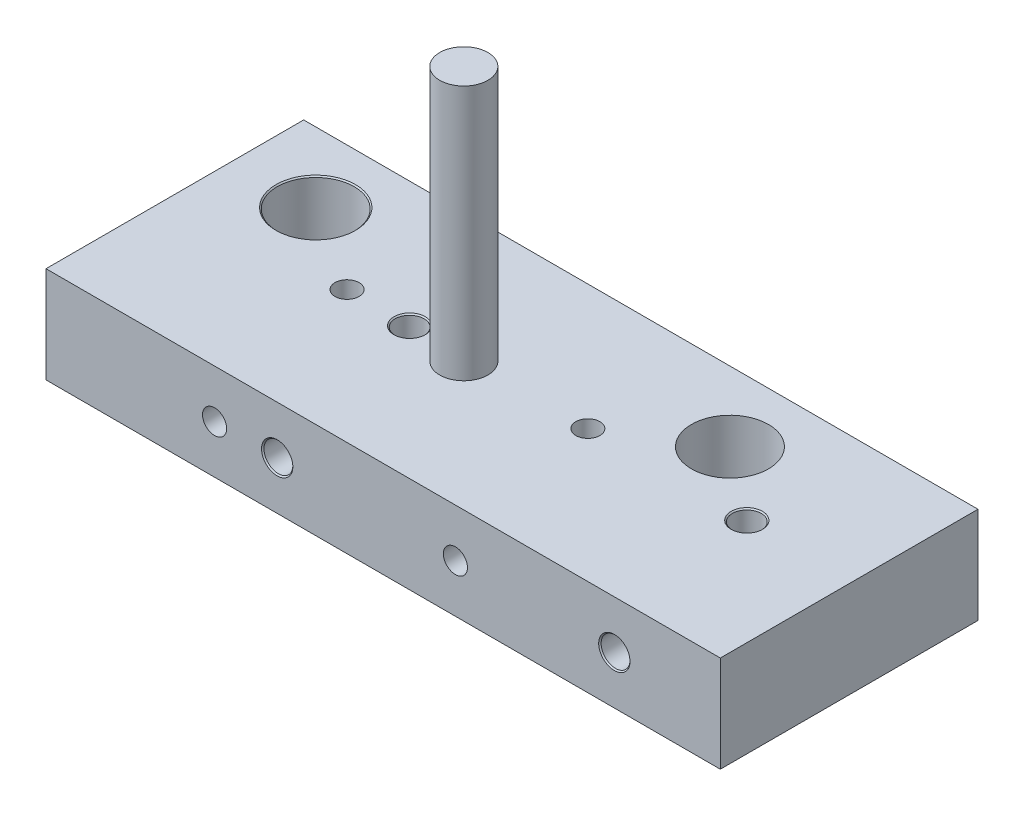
ISO-10303-21;
HEADER;
FILE_DESCRIPTION(('STEP AP214'),'2;1');
FILE_NAME('part.step','',(''),(''),'','','');
FILE_SCHEMA(('AUTOMOTIVE_DESIGN { 1 0 10303 214 1 1 1 1 }'));
ENDSEC;
DATA;
#1=APPLICATION_CONTEXT('core data for automotive mechanical design processes');
#2=APPLICATION_PROTOCOL_DEFINITION('international standard','automotive_design',2000,#1);
#3=PRODUCT_CONTEXT('',#1,'mechanical');
#4=PRODUCT('Part','Part','',(#3));
#5=PRODUCT_RELATED_PRODUCT_CATEGORY('part','',(#4));
#6=PRODUCT_DEFINITION_FORMATION('','',#4);
#7=PRODUCT_DEFINITION_CONTEXT('part definition',#1,'design');
#8=PRODUCT_DEFINITION('design','',#6,#7);
#9=PRODUCT_DEFINITION_SHAPE('','',#8);
#10=(LENGTH_UNIT() NAMED_UNIT(*) SI_UNIT(.MILLI.,.METRE.));
#11=(NAMED_UNIT(*) PLANE_ANGLE_UNIT() SI_UNIT($,.RADIAN.));
#12=(NAMED_UNIT(*) SI_UNIT($,.STERADIAN.) SOLID_ANGLE_UNIT());
#13=UNCERTAINTY_MEASURE_WITH_UNIT(LENGTH_MEASURE(1.E-05),#10,'distance_accuracy_value','');
#14=(GEOMETRIC_REPRESENTATION_CONTEXT(3) GLOBAL_UNCERTAINTY_ASSIGNED_CONTEXT((#13)) GLOBAL_UNIT_ASSIGNED_CONTEXT((#10,
#11,#12)) REPRESENTATION_CONTEXT('',''));
#15=CARTESIAN_POINT('',(0.,0.,0.));
#16=DIRECTION('',(0.,0.,1.));
#17=DIRECTION('',(1.,0.,0.));
#18=AXIS2_PLACEMENT_3D('',#15,#16,#17);
#19=CARTESIAN_POINT('',(0.,20.,-53.5));
#20=DIRECTION('',(0.,-1.,0.));
#21=DIRECTION('',(0.,0.,-1.));
#22=AXIS2_PLACEMENT_3D('',#19,#20,#21);
#23=PLANE('',#22);
#24=CARTESIAN_POINT('',(103.,20.,-39.));
#25=DIRECTION('',(0.,-1.,0.));
#26=DIRECTION('',(0.,0.,-1.));
#27=AXIS2_PLACEMENT_3D('',#24,#25,#26);
#28=CIRCLE('',#27,7.99999999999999);
#29=CARTESIAN_POINT('',(103.,20.,-47.));
#30=VERTEX_POINT('',#29);
#31=EDGE_CURVE('E9179',#30,#30,#28,.T.);
#32=ORIENTED_EDGE('',*,*,#31,.T.);
#33=EDGE_LOOP('',(#32));
#34=FACE_BOUND('',#33,.T.);
#35=DIRECTION('',(0.,0.,1.));
#36=VECTOR('',#35,1.);
#37=CARTESIAN_POINT('',(0.,20.,0.));
#38=LINE('',#37,#36);
#39=CARTESIAN_POINT('',(0.,20.,-53.5));
#40=VERTEX_POINT('',#39);
#41=CARTESIAN_POINT('',(0.,20.,0.));
#42=VERTEX_POINT('',#41);
#43=EDGE_CURVE('E9307',#40,#42,#38,.T.);
#44=ORIENTED_EDGE('',*,*,#43,.T.);
#45=DIRECTION('',(1.,0.,0.));
#46=VECTOR('',#45,1.);
#47=CARTESIAN_POINT('',(0.,20.,0.));
#48=LINE('',#47,#46);
#49=CARTESIAN_POINT('',(140.,20.,0.));
#50=VERTEX_POINT('',#49);
#51=EDGE_CURVE('E9305',#42,#50,#48,.T.);
#52=ORIENTED_EDGE('',*,*,#51,.T.);
#53=DIRECTION('',(0.,0.,-1.));
#54=VECTOR('',#53,1.);
#55=CARTESIAN_POINT('',(140.,20.,0.));
#56=LINE('',#55,#54);
#57=CARTESIAN_POINT('',(140.,20.,-53.5));
#58=VERTEX_POINT('',#57);
#59=EDGE_CURVE('E9303',#50,#58,#56,.T.);
#60=ORIENTED_EDGE('',*,*,#59,.T.);
#61=DIRECTION('',(-1.,0.,0.));
#62=VECTOR('',#61,1.);
#63=CARTESIAN_POINT('',(0.,20.,-53.5));
#64=LINE('',#63,#62);
#65=EDGE_CURVE('E9301',#58,#40,#64,.T.);
#66=ORIENTED_EDGE('',*,*,#65,.T.);
#67=EDGE_LOOP('',(#44,#52,#60,#66));
#68=FACE_BOUND('',#67,.T.);
#69=CARTESIAN_POINT('',(17.,20.,-39.));
#70=DIRECTION('',(0.,-1.,0.));
#71=DIRECTION('',(0.,0.,-1.));
#72=AXIS2_PLACEMENT_3D('',#69,#70,#71);
#73=CIRCLE('',#72,8.24999999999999);
#74=CARTESIAN_POINT('',(17.,20.,-47.25));
#75=VERTEX_POINT('',#74);
#76=EDGE_CURVE('E9328',#75,#75,#73,.T.);
#77=ORIENTED_EDGE('',*,*,#76,.T.);
#78=EDGE_LOOP('',(#77));
#79=FACE_BOUND('',#78,.T.);
#80=CARTESIAN_POINT('',(35.,20.,-27.5));
#81=DIRECTION('',(0.,-1.,0.));
#82=DIRECTION('',(0.,0.,-1.));
#83=AXIS2_PLACEMENT_3D('',#80,#81,#82);
#84=CIRCLE('',#83,2.5);
#85=CARTESIAN_POINT('',(35.,20.,-30.));
#86=VERTEX_POINT('',#85);
#87=EDGE_CURVE('E9334',#86,#86,#84,.T.);
#88=ORIENTED_EDGE('',*,*,#87,.T.);
#89=EDGE_LOOP('',(#88));
#90=FACE_BOUND('',#89,.T.);
#91=CARTESIAN_POINT('',(85.,20.,-27.5));
#92=DIRECTION('',(0.,-1.,0.));
#93=DIRECTION('',(0.,0.,-1.));
#94=AXIS2_PLACEMENT_3D('',#91,#92,#93);
#95=CIRCLE('',#94,2.49999999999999);
#96=CARTESIAN_POINT('',(85.,20.,-30.));
#97=VERTEX_POINT('',#96);
#98=EDGE_CURVE('E9340',#97,#97,#95,.T.);
#99=ORIENTED_EDGE('',*,*,#98,.T.);
#100=EDGE_LOOP('',(#99));
#101=FACE_BOUND('',#100,.T.);
#102=CARTESIAN_POINT('',(48.,20.,-27.5));
#103=DIRECTION('',(0.,-1.,0.));
#104=DIRECTION('',(0.,0.,-1.));
#105=AXIS2_PLACEMENT_3D('',#102,#103,#104);
#106=CIRCLE('',#105,3.25);
#107=CARTESIAN_POINT('',(48.,20.,-30.75));
#108=VERTEX_POINT('',#107);
#109=EDGE_CURVE('E9352',#108,#108,#106,.T.);
#110=ORIENTED_EDGE('',*,*,#109,.T.);
#111=EDGE_LOOP('',(#110));
#112=FACE_BOUND('',#111,.T.);
#113=CARTESIAN_POINT('',(118.,20.,-27.5));
#114=DIRECTION('',(0.,-1.,0.));
#115=DIRECTION('',(0.,0.,-1.));
#116=AXIS2_PLACEMENT_3D('',#113,#114,#115);
#117=CIRCLE('',#116,3.24999999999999);
#118=CARTESIAN_POINT('',(118.,20.,-30.75));
#119=VERTEX_POINT('',#118);
#120=EDGE_CURVE('E9364',#119,#119,#117,.T.);
#121=ORIENTED_EDGE('',*,*,#120,.T.);
#122=EDGE_LOOP('',(#121));
#123=FACE_BOUND('',#122,.T.);
#124=CARTESIAN_POINT('',(60.,20.,-26.75));
#125=DIRECTION('',(0.,-1.,0.));
#126=DIRECTION('',(0.,0.,-1.));
#127=AXIS2_PLACEMENT_3D('',#124,#125,#126);
#128=CIRCLE('',#127,5.);
#129=CARTESIAN_POINT('',(60.,20.,-31.75));
#130=VERTEX_POINT('',#129);
#131=EDGE_CURVE('E11',#130,#130,#128,.F.);
#132=ORIENTED_EDGE('',*,*,#131,.F.);
#133=EDGE_LOOP('',(#132));
#134=FACE_BOUND('',#133,.T.);
#135=ADVANCED_FACE('F9175',(#34,#68,#79,#90,#101,#112,#123,#134),#23,.F.);
#136=CARTESIAN_POINT('',(85.,0.,-27.5));
#137=DIRECTION('',(0.,-1.,0.));
#138=DIRECTION('',(0.,0.,-1.));
#139=AXIS2_PLACEMENT_3D('',#136,#137,#138);
#140=CYLINDRICAL_SURFACE('',#139,2.49999999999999);
#141=CARTESIAN_POINT('',(85.,0.,-27.5));
#142=DIRECTION('',(0.,-1.,0.));
#143=DIRECTION('',(0.,0.,-1.));
#144=AXIS2_PLACEMENT_3D('',#141,#142,#143);
#145=CIRCLE('',#144,2.49999999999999);
#146=CARTESIAN_POINT('',(85.,0.,-30.));
#147=VERTEX_POINT('',#146);
#148=EDGE_CURVE('E9337',#147,#147,#145,.T.);
#149=ORIENTED_EDGE('',*,*,#148,.T.);
#150=EDGE_LOOP('',(#149));
#151=FACE_BOUND('',#150,.T.);
#152=CARTESIAN_POINT('',(85.,10.,-27.5));
#153=DIRECTION('',(0.,-0.707106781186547,-0.707106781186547));
#154=DIRECTION('',(0.,-0.707106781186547,0.707106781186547));
#155=AXIS2_PLACEMENT_3D('',#152,#153,#154);
#156=ELLIPSE('',#155,3.53553390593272,2.49999999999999);
#157=CARTESIAN_POINT('',(82.5,10.,-27.5));
#158=VERTEX_POINT('',#157);
#159=CARTESIAN_POINT('',(87.5,10.,-27.5));
#160=VERTEX_POINT('',#159);
#161=EDGE_CURVE('E9190',#158,#160,#156,.F.);
#162=ORIENTED_EDGE('',*,*,#161,.T.);
#163=CARTESIAN_POINT('',(85.,10.,-27.5));
#164=DIRECTION('',(0.,-0.707106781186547,0.707106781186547));
#165=DIRECTION('',(0.,-0.707106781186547,-0.707106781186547));
#166=AXIS2_PLACEMENT_3D('',#163,#164,#165);
#167=ELLIPSE('',#166,3.53553390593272,2.49999999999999);
#168=EDGE_CURVE('E9184',#160,#158,#167,.F.);
#169=ORIENTED_EDGE('',*,*,#168,.T.);
#170=EDGE_LOOP('',(#162,#169));
#171=FACE_BOUND('',#170,.T.);
#172=ADVANCED_FACE('F9253',(#151,#171),#140,.F.);
#173=CARTESIAN_POINT('',(35.,0.,-27.5));
#174=DIRECTION('',(0.,-1.,0.));
#175=DIRECTION('',(0.,0.,-1.));
#176=AXIS2_PLACEMENT_3D('',#173,#174,#175);
#177=CYLINDRICAL_SURFACE('',#176,2.49999999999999);
#178=CARTESIAN_POINT('',(35.,0.,-27.5));
#179=DIRECTION('',(0.,-1.,0.));
#180=DIRECTION('',(0.,0.,-1.));
#181=AXIS2_PLACEMENT_3D('',#178,#179,#180);
#182=CIRCLE('',#181,2.49999999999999);
#183=CARTESIAN_POINT('',(35.,0.,-30.));
#184=VERTEX_POINT('',#183);
#185=EDGE_CURVE('E9331',#184,#184,#182,.T.);
#186=ORIENTED_EDGE('',*,*,#185,.T.);
#187=EDGE_LOOP('',(#186));
#188=FACE_BOUND('',#187,.T.);
#189=CARTESIAN_POINT('',(35.,10.,-27.5));
#190=DIRECTION('',(0.,-0.707106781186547,-0.707106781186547));
#191=DIRECTION('',(0.,-0.707106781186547,0.707106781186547));
#192=AXIS2_PLACEMENT_3D('',#189,#190,#191);
#193=ELLIPSE('',#192,3.53553390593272,2.49999999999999);
#194=CARTESIAN_POINT('',(32.5,10.,-27.5));
#195=VERTEX_POINT('',#194);
#196=CARTESIAN_POINT('',(37.5,10.,-27.5));
#197=VERTEX_POINT('',#196);
#198=EDGE_CURVE('E9197',#195,#197,#193,.F.);
#199=ORIENTED_EDGE('',*,*,#198,.T.);
#200=CARTESIAN_POINT('',(35.,10.,-27.5));
#201=DIRECTION('',(0.,-0.707106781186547,0.707106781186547));
#202=DIRECTION('',(0.,-0.707106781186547,-0.707106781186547));
#203=AXIS2_PLACEMENT_3D('',#200,#201,#202);
#204=ELLIPSE('',#203,3.53553390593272,2.49999999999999);
#205=EDGE_CURVE('E9251',#197,#195,#204,.F.);
#206=ORIENTED_EDGE('',*,*,#205,.T.);
#207=EDGE_LOOP('',(#199,#206));
#208=FACE_BOUND('',#207,.T.);
#209=ADVANCED_FACE('F9550',(#188,#208),#177,.F.);
#210=CARTESIAN_POINT('',(118.,0.,-27.5));
#211=DIRECTION('',(0.,-1.,0.));
#212=DIRECTION('',(0.,0.,-1.));
#213=AXIS2_PLACEMENT_3D('',#210,#211,#212);
#214=CYLINDRICAL_SURFACE('',#213,3.);
#215=CARTESIAN_POINT('',(118.,0.250000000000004,-27.5));
#216=DIRECTION('',(0.,-1.,0.));
#217=DIRECTION('',(0.,0.,-1.));
#218=AXIS2_PLACEMENT_3D('',#215,#216,#217);
#219=CIRCLE('',#218,3.);
#220=CARTESIAN_POINT('',(118.,0.250000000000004,-30.5));
#221=VERTEX_POINT('',#220);
#222=EDGE_CURVE('E9358',#221,#221,#219,.T.);
#223=ORIENTED_EDGE('',*,*,#222,.T.);
#224=EDGE_LOOP('',(#223));
#225=FACE_BOUND('',#224,.T.);
#226=CARTESIAN_POINT('',(118.,10.,-27.5));
#227=DIRECTION('',(0.,-0.707106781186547,-0.707106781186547));
#228=DIRECTION('',(0.,-0.707106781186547,0.707106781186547));
#229=AXIS2_PLACEMENT_3D('',#226,#227,#228);
#230=ELLIPSE('',#229,4.24264068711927,2.99999999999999);
#231=CARTESIAN_POINT('',(115.,10.,-27.5));
#232=VERTEX_POINT('',#231);
#233=CARTESIAN_POINT('',(121.,10.,-27.5));
#234=VERTEX_POINT('',#233);
#235=EDGE_CURVE('E9276',#232,#234,#230,.F.);
#236=ORIENTED_EDGE('',*,*,#235,.T.);
#237=CARTESIAN_POINT('',(118.,10.,-27.5));
#238=DIRECTION('',(0.,-0.707106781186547,0.707106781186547));
#239=DIRECTION('',(0.,-0.707106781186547,-0.707106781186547));
#240=AXIS2_PLACEMENT_3D('',#237,#238,#239);
#241=ELLIPSE('',#240,4.24264068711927,2.99999999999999);
#242=EDGE_CURVE('E9267',#234,#232,#241,.F.);
#243=ORIENTED_EDGE('',*,*,#242,.T.);
#244=EDGE_LOOP('',(#236,#243));
#245=FACE_BOUND('',#244,.T.);
#246=ADVANCED_FACE('F9526',(#225,#245),#214,.F.);
#247=CARTESIAN_POINT('',(48.,0.,-27.5));
#248=DIRECTION('',(0.,-1.,0.));
#249=DIRECTION('',(0.,0.,-1.));
#250=AXIS2_PLACEMENT_3D('',#247,#248,#249);
#251=CYLINDRICAL_SURFACE('',#250,3.);
#252=CARTESIAN_POINT('',(48.,0.250000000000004,-27.5));
#253=DIRECTION('',(0.,-1.,0.));
#254=DIRECTION('',(0.,0.,-1.));
#255=AXIS2_PLACEMENT_3D('',#252,#253,#254);
#256=CIRCLE('',#255,3.);
#257=CARTESIAN_POINT('',(48.,0.250000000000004,-30.5));
#258=VERTEX_POINT('',#257);
#259=EDGE_CURVE('E9346',#258,#258,#256,.T.);
#260=ORIENTED_EDGE('',*,*,#259,.T.);
#261=EDGE_LOOP('',(#260));
#262=FACE_BOUND('',#261,.T.);
#263=CARTESIAN_POINT('',(48.,10.,-27.5));
#264=DIRECTION('',(0.,-0.707106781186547,-0.707106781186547));
#265=DIRECTION('',(0.,-0.707106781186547,0.707106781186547));
#266=AXIS2_PLACEMENT_3D('',#263,#264,#265);
#267=ELLIPSE('',#266,4.24264068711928,2.99999999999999);
#268=CARTESIAN_POINT('',(45.,10.,-27.5));
#269=VERTEX_POINT('',#268);
#270=CARTESIAN_POINT('',(51.,10.,-27.5));
#271=VERTEX_POINT('',#270);
#272=EDGE_CURVE('E9287',#269,#271,#267,.F.);
#273=ORIENTED_EDGE('',*,*,#272,.T.);
#274=CARTESIAN_POINT('',(48.,10.,-27.5));
#275=DIRECTION('',(0.,-0.707106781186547,0.707106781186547));
#276=DIRECTION('',(0.,-0.707106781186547,-0.707106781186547));
#277=AXIS2_PLACEMENT_3D('',#274,#275,#276);
#278=ELLIPSE('',#277,4.24264068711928,2.99999999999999);
#279=EDGE_CURVE('E9278',#271,#269,#278,.F.);
#280=ORIENTED_EDGE('',*,*,#279,.T.);
#281=EDGE_LOOP('',(#273,#280));
#282=FACE_BOUND('',#281,.T.);
#283=ADVANCED_FACE('F9539',(#262,#282),#251,.F.);
#284=CARTESIAN_POINT('',(0.,20.,0.));
#285=DIRECTION('',(1.,0.,0.));
#286=DIRECTION('',(0.,0.,-1.));
#287=AXIS2_PLACEMENT_3D('',#284,#285,#286);
#288=PLANE('',#287);
#289=DIRECTION('',(0.,0.,1.));
#290=VECTOR('',#289,1.);
#291=CARTESIAN_POINT('',(0.,0.,0.));
#292=LINE('',#291,#290);
#293=CARTESIAN_POINT('',(0.,0.,-53.5));
#294=VERTEX_POINT('',#293);
#295=CARTESIAN_POINT('',(0.,0.,0.));
#296=VERTEX_POINT('',#295);
#297=EDGE_CURVE('E9316',#294,#296,#292,.T.);
#298=ORIENTED_EDGE('',*,*,#297,.T.);
#299=DIRECTION('',(0.,-1.,0.));
#300=VECTOR('',#299,1.);
#301=CARTESIAN_POINT('',(0.,20.,0.));
#302=LINE('',#301,#300);
#303=EDGE_CURVE('E9289',#42,#296,#302,.T.);
#304=ORIENTED_EDGE('',*,*,#303,.F.);
#305=ORIENTED_EDGE('',*,*,#43,.F.);
#306=DIRECTION('',(0.,-1.,0.));
#307=VECTOR('',#306,1.);
#308=CARTESIAN_POINT('',(0.,20.,-53.5));
#309=LINE('',#308,#307);
#310=EDGE_CURVE('E9298',#40,#294,#309,.T.);
#311=ORIENTED_EDGE('',*,*,#310,.T.);
#312=EDGE_LOOP('',(#298,#304,#305,#311));
#313=FACE_BOUND('',#312,.T.);
#314=ADVANCED_FACE('F9177',(#313),#288,.F.);
#315=CARTESIAN_POINT('',(0.,20.,0.));
#316=DIRECTION('',(0.,0.,-1.));
#317=DIRECTION('',(-1.,0.,0.));
#318=AXIS2_PLACEMENT_3D('',#315,#316,#317);
#319=PLANE('',#318);
#320=CARTESIAN_POINT('',(85.,10.,0.));
#321=DIRECTION('',(0.,0.,1.));
#322=DIRECTION('',(1.,0.,0.));
#323=AXIS2_PLACEMENT_3D('',#320,#321,#322);
#324=CIRCLE('',#323,2.49999999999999);
#325=CARTESIAN_POINT('',(87.5,10.,0.));
#326=VERTEX_POINT('',#325);
#327=EDGE_CURVE('E9397',#326,#326,#324,.T.);
#328=ORIENTED_EDGE('',*,*,#327,.F.);
#329=EDGE_LOOP('',(#328));
#330=FACE_BOUND('',#329,.T.);
#331=CARTESIAN_POINT('',(35.,10.,0.));
#332=DIRECTION('',(0.,0.,1.));
#333=DIRECTION('',(1.,0.,0.));
#334=AXIS2_PLACEMENT_3D('',#331,#332,#333);
#335=CIRCLE('',#334,2.49999999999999);
#336=CARTESIAN_POINT('',(37.5,10.,0.));
#337=VERTEX_POINT('',#336);
#338=EDGE_CURVE('E9391',#337,#337,#335,.T.);
#339=ORIENTED_EDGE('',*,*,#338,.F.);
#340=EDGE_LOOP('',(#339));
#341=FACE_BOUND('',#340,.T.);
#342=CARTESIAN_POINT('',(118.,10.,0.));
#343=DIRECTION('',(0.,0.,1.));
#344=DIRECTION('',(1.,0.,0.));
#345=AXIS2_PLACEMENT_3D('',#342,#343,#344);
#346=CIRCLE('',#345,3.25);
#347=CARTESIAN_POINT('',(121.25,10.,0.));
#348=VERTEX_POINT('',#347);
#349=EDGE_CURVE('E9379',#348,#348,#346,.T.);
#350=ORIENTED_EDGE('',*,*,#349,.F.);
#351=EDGE_LOOP('',(#350));
#352=FACE_BOUND('',#351,.T.);
#353=CARTESIAN_POINT('',(48.,10.,0.));
#354=DIRECTION('',(0.,0.,1.));
#355=DIRECTION('',(1.,0.,0.));
#356=AXIS2_PLACEMENT_3D('',#353,#354,#355);
#357=CIRCLE('',#356,3.25);
#358=CARTESIAN_POINT('',(51.25,10.,0.));
#359=VERTEX_POINT('',#358);
#360=EDGE_CURVE('E9367',#359,#359,#357,.T.);
#361=ORIENTED_EDGE('',*,*,#360,.F.);
#362=EDGE_LOOP('',(#361));
#363=FACE_BOUND('',#362,.T.);
#364=DIRECTION('',(1.,0.,0.));
#365=VECTOR('',#364,1.);
#366=CARTESIAN_POINT('',(0.,0.,0.));
#367=LINE('',#366,#365);
#368=CARTESIAN_POINT('',(140.,0.,0.));
#369=VERTEX_POINT('',#368);
#370=EDGE_CURVE('E9314',#296,#369,#367,.T.);
#371=ORIENTED_EDGE('',*,*,#370,.T.);
#372=DIRECTION('',(0.,-1.,0.));
#373=VECTOR('',#372,1.);
#374=CARTESIAN_POINT('',(140.,20.,0.));
#375=LINE('',#374,#373);
#376=EDGE_CURVE('E9292',#50,#369,#375,.T.);
#377=ORIENTED_EDGE('',*,*,#376,.F.);
#378=ORIENTED_EDGE('',*,*,#51,.F.);
#379=ORIENTED_EDGE('',*,*,#303,.T.);
#380=EDGE_LOOP('',(#371,#377,#378,#379));
#381=FACE_BOUND('',#380,.T.);
#382=ADVANCED_FACE('F9453',(#330,#341,#352,#363,#381),#319,.F.);
#383=CARTESIAN_POINT('',(140.,20.,0.));
#384=DIRECTION('',(-1.,0.,0.));
#385=DIRECTION('',(0.,0.,1.));
#386=AXIS2_PLACEMENT_3D('',#383,#384,#385);
#387=PLANE('',#386);
#388=DIRECTION('',(0.,0.,-1.));
#389=VECTOR('',#388,1.);
#390=CARTESIAN_POINT('',(140.,0.,0.));
#391=LINE('',#390,#389);
#392=CARTESIAN_POINT('',(140.,0.,-53.5));
#393=VERTEX_POINT('',#392);
#394=EDGE_CURVE('E9312',#369,#393,#391,.T.);
#395=ORIENTED_EDGE('',*,*,#394,.T.);
#396=DIRECTION('',(0.,-1.,0.));
#397=VECTOR('',#396,1.);
#398=CARTESIAN_POINT('',(140.,20.,-53.5));
#399=LINE('',#398,#397);
#400=EDGE_CURVE('E9295',#58,#393,#399,.T.);
#401=ORIENTED_EDGE('',*,*,#400,.F.);
#402=ORIENTED_EDGE('',*,*,#59,.F.);
#403=ORIENTED_EDGE('',*,*,#376,.T.);
#404=EDGE_LOOP('',(#395,#401,#402,#403));
#405=FACE_BOUND('',#404,.T.);
#406=ADVANCED_FACE('F9450',(#405),#387,.F.);
#407=CARTESIAN_POINT('',(0.,20.,-53.5));
#408=DIRECTION('',(0.,0.,1.));
#409=DIRECTION('',(1.,0.,0.));
#410=AXIS2_PLACEMENT_3D('',#407,#408,#409);
#411=PLANE('',#410);
#412=CARTESIAN_POINT('',(85.,10.,-53.5));
#413=DIRECTION('',(0.,0.,1.));
#414=DIRECTION('',(1.,0.,0.));
#415=AXIS2_PLACEMENT_3D('',#412,#413,#414);
#416=CIRCLE('',#415,2.49999999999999);
#417=CARTESIAN_POINT('',(87.5,10.,-53.5));
#418=VERTEX_POINT('',#417);
#419=EDGE_CURVE('E9400',#418,#418,#416,.T.);
#420=ORIENTED_EDGE('',*,*,#419,.T.);
#421=EDGE_LOOP('',(#420));
#422=FACE_BOUND('',#421,.T.);
#423=CARTESIAN_POINT('',(35.,10.,-53.5));
#424=DIRECTION('',(0.,0.,1.));
#425=DIRECTION('',(1.,0.,0.));
#426=AXIS2_PLACEMENT_3D('',#423,#424,#425);
#427=CIRCLE('',#426,2.49999999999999);
#428=CARTESIAN_POINT('',(37.5,10.,-53.5));
#429=VERTEX_POINT('',#428);
#430=EDGE_CURVE('E9394',#429,#429,#427,.T.);
#431=ORIENTED_EDGE('',*,*,#430,.T.);
#432=EDGE_LOOP('',(#431));
#433=FACE_BOUND('',#432,.T.);
#434=CARTESIAN_POINT('',(118.,10.,-53.5));
#435=DIRECTION('',(0.,0.,1.));
#436=DIRECTION('',(1.,0.,0.));
#437=AXIS2_PLACEMENT_3D('',#434,#435,#436);
#438=CIRCLE('',#437,3.24999999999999);
#439=CARTESIAN_POINT('',(121.25,10.,-53.5));
#440=VERTEX_POINT('',#439);
#441=EDGE_CURVE('E9388',#440,#440,#438,.T.);
#442=ORIENTED_EDGE('',*,*,#441,.T.);
#443=EDGE_LOOP('',(#442));
#444=FACE_BOUND('',#443,.T.);
#445=CARTESIAN_POINT('',(48.,10.,-53.5));
#446=DIRECTION('',(0.,0.,1.));
#447=DIRECTION('',(1.,0.,0.));
#448=AXIS2_PLACEMENT_3D('',#445,#446,#447);
#449=CIRCLE('',#448,3.24999999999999);
#450=CARTESIAN_POINT('',(51.25,10.,-53.5));
#451=VERTEX_POINT('',#450);
#452=EDGE_CURVE('E9376',#451,#451,#449,.T.);
#453=ORIENTED_EDGE('',*,*,#452,.T.);
#454=EDGE_LOOP('',(#453));
#455=FACE_BOUND('',#454,.T.);
#456=DIRECTION('',(-1.,0.,0.));
#457=VECTOR('',#456,1.);
#458=CARTESIAN_POINT('',(0.,0.,-53.5));
#459=LINE('',#458,#457);
#460=EDGE_CURVE('E9310',#393,#294,#459,.T.);
#461=ORIENTED_EDGE('',*,*,#460,.T.);
#462=ORIENTED_EDGE('',*,*,#310,.F.);
#463=ORIENTED_EDGE('',*,*,#65,.F.);
#464=ORIENTED_EDGE('',*,*,#400,.T.);
#465=EDGE_LOOP('',(#461,#462,#463,#464));
#466=FACE_BOUND('',#465,.T.);
#467=ADVANCED_FACE('F9426',(#422,#433,#444,#455,#466),#411,.F.);
#468=CARTESIAN_POINT('',(0.,0.,-53.5));
#469=DIRECTION('',(0.,-1.,0.));
#470=DIRECTION('',(0.,0.,-1.));
#471=AXIS2_PLACEMENT_3D('',#468,#469,#470);
#472=PLANE('',#471);
#473=CARTESIAN_POINT('',(103.,0.,-39.));
#474=DIRECTION('',(0.,-1.,0.));
#475=DIRECTION('',(0.,0.,-1.));
#476=AXIS2_PLACEMENT_3D('',#473,#474,#475);
#477=CIRCLE('',#476,8.25000000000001);
#478=CARTESIAN_POINT('',(103.,0.,-47.25));
#479=VERTEX_POINT('',#478);
#480=EDGE_CURVE('E9406',#479,#479,#477,.T.);
#481=ORIENTED_EDGE('',*,*,#480,.F.);
#482=EDGE_LOOP('',(#481));
#483=FACE_BOUND('',#482,.T.);
#484=CARTESIAN_POINT('',(118.,0.,-27.5));
#485=DIRECTION('',(0.,-1.,0.));
#486=DIRECTION('',(0.,0.,-1.));
#487=AXIS2_PLACEMENT_3D('',#484,#485,#486);
#488=CIRCLE('',#487,3.25);
#489=CARTESIAN_POINT('',(118.,0.,-30.75));
#490=VERTEX_POINT('',#489);
#491=EDGE_CURVE('E9355',#490,#490,#488,.T.);
#492=ORIENTED_EDGE('',*,*,#491,.F.);
#493=EDGE_LOOP('',(#492));
#494=FACE_BOUND('',#493,.T.);
#495=CARTESIAN_POINT('',(48.,0.,-27.5));
#496=DIRECTION('',(0.,-1.,0.));
#497=DIRECTION('',(0.,0.,-1.));
#498=AXIS2_PLACEMENT_3D('',#495,#496,#497);
#499=CIRCLE('',#498,3.25);
#500=CARTESIAN_POINT('',(48.,0.,-30.75));
#501=VERTEX_POINT('',#500);
#502=EDGE_CURVE('E9343',#501,#501,#499,.T.);
#503=ORIENTED_EDGE('',*,*,#502,.F.);
#504=EDGE_LOOP('',(#503));
#505=FACE_BOUND('',#504,.T.);
#506=ORIENTED_EDGE('',*,*,#148,.F.);
#507=EDGE_LOOP('',(#506));
#508=FACE_BOUND('',#507,.T.);
#509=ORIENTED_EDGE('',*,*,#185,.F.);
#510=EDGE_LOOP('',(#509));
#511=FACE_BOUND('',#510,.T.);
#512=CARTESIAN_POINT('',(17.,0.,-39.));
#513=DIRECTION('',(0.,-1.,0.));
#514=DIRECTION('',(0.,0.,-1.));
#515=AXIS2_PLACEMENT_3D('',#512,#513,#514);
#516=CIRCLE('',#515,8.25);
#517=CARTESIAN_POINT('',(17.,0.,-47.25));
#518=VERTEX_POINT('',#517);
#519=EDGE_CURVE('E9319',#518,#518,#516,.T.);
#520=ORIENTED_EDGE('',*,*,#519,.F.);
#521=EDGE_LOOP('',(#520));
#522=FACE_BOUND('',#521,.T.);
#523=ORIENTED_EDGE('',*,*,#297,.F.);
#524=ORIENTED_EDGE('',*,*,#460,.F.);
#525=ORIENTED_EDGE('',*,*,#394,.F.);
#526=ORIENTED_EDGE('',*,*,#370,.F.);
#527=EDGE_LOOP('',(#523,#524,#525,#526));
#528=FACE_BOUND('',#527,.T.);
#529=ADVANCED_FACE('F9422',(#483,#494,#505,#508,#511,#522,#528),#472,.T.);
#530=CARTESIAN_POINT('',(17.,0.,-39.));
#531=DIRECTION('',(0.,-1.,0.));
#532=DIRECTION('',(0.,0.,-1.));
#533=AXIS2_PLACEMENT_3D('',#530,#531,#532);
#534=CONICAL_SURFACE('',#533,8.25,0.785398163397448);
#535=CARTESIAN_POINT('',(17.,0.250000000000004,-39.));
#536=DIRECTION('',(0.,-1.,0.));
#537=DIRECTION('',(0.,0.,-1.));
#538=AXIS2_PLACEMENT_3D('',#535,#536,#537);
#539=CIRCLE('',#538,8.);
#540=CARTESIAN_POINT('',(17.,0.250000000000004,-47.));
#541=VERTEX_POINT('',#540);
#542=EDGE_CURVE('E9322',#541,#541,#539,.T.);
#543=ORIENTED_EDGE('',*,*,#542,.F.);
#544=EDGE_LOOP('',(#543));
#545=FACE_BOUND('',#544,.T.);
#546=ORIENTED_EDGE('',*,*,#519,.T.);
#547=EDGE_LOOP('',(#546));
#548=FACE_BOUND('',#547,.T.);
#549=ADVANCED_FACE('F9425',(#545,#548),#534,.F.);
#550=CARTESIAN_POINT('',(17.,0.,-39.));
#551=DIRECTION('',(0.,-1.,0.));
#552=DIRECTION('',(0.,0.,-1.));
#553=AXIS2_PLACEMENT_3D('',#550,#551,#552);
#554=CYLINDRICAL_SURFACE('',#553,7.99999999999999);
#555=CARTESIAN_POINT('',(17.,19.75,-39.));
#556=DIRECTION('',(0.,-1.,0.));
#557=DIRECTION('',(0.,0.,-1.));
#558=AXIS2_PLACEMENT_3D('',#555,#556,#557);
#559=CIRCLE('',#558,7.99999999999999);
#560=CARTESIAN_POINT('',(17.,19.75,-47.));
#561=VERTEX_POINT('',#560);
#562=EDGE_CURVE('E9325',#561,#561,#559,.T.);
#563=ORIENTED_EDGE('',*,*,#562,.F.);
#564=EDGE_LOOP('',(#563));
#565=FACE_BOUND('',#564,.T.);
#566=ORIENTED_EDGE('',*,*,#542,.T.);
#567=EDGE_LOOP('',(#566));
#568=FACE_BOUND('',#567,.T.);
#569=ADVANCED_FACE('F9553',(#565,#568),#554,.F.);
#570=CARTESIAN_POINT('',(17.,19.75,-39.));
#571=DIRECTION('',(0.,1.,0.));
#572=DIRECTION('',(0.,0.,1.));
#573=AXIS2_PLACEMENT_3D('',#570,#571,#572);
#574=CONICAL_SURFACE('',#573,7.99999999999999,0.785398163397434);
#575=ORIENTED_EDGE('',*,*,#76,.F.);
#576=EDGE_LOOP('',(#575));
#577=FACE_BOUND('',#576,.T.);
#578=ORIENTED_EDGE('',*,*,#562,.T.);
#579=EDGE_LOOP('',(#578));
#580=FACE_BOUND('',#579,.T.);
#581=ADVANCED_FACE('F9548',(#577,#580),#574,.F.);
#582=CARTESIAN_POINT('',(35.,10.,-27.5));
#583=DIRECTION('',(0.,-0.707106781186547,-0.707106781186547));
#584=DIRECTION('',(0.,-0.707106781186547,0.707106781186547));
#585=AXIS2_PLACEMENT_3D('',#582,#583,#584);
#586=ELLIPSE('',#585,3.53553390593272,2.49999999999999);
#587=EDGE_CURVE('E9263',#195,#197,#586,.T.);
#588=ORIENTED_EDGE('',*,*,#587,.T.);
#589=CARTESIAN_POINT('',(35.,10.,-27.5));
#590=DIRECTION('',(0.,-0.707106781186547,0.707106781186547));
#591=DIRECTION('',(0.,-0.707106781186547,-0.707106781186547));
#592=AXIS2_PLACEMENT_3D('',#589,#590,#591);
#593=ELLIPSE('',#592,3.53553390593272,2.49999999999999);
#594=EDGE_CURVE('E9260',#197,#195,#593,.T.);
#595=ORIENTED_EDGE('',*,*,#594,.T.);
#596=EDGE_LOOP('',(#588,#595));
#597=FACE_BOUND('',#596,.T.);
#598=ORIENTED_EDGE('',*,*,#87,.F.);
#599=EDGE_LOOP('',(#598));
#600=FACE_BOUND('',#599,.T.);
#601=ADVANCED_FACE('F9545',(#597,#600),#177,.F.);
#602=CARTESIAN_POINT('',(85.,10.,-27.5));
#603=DIRECTION('',(0.,-0.707106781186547,-0.707106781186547));
#604=DIRECTION('',(0.,-0.707106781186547,0.707106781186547));
#605=AXIS2_PLACEMENT_3D('',#602,#603,#604);
#606=ELLIPSE('',#605,3.53553390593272,2.49999999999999);
#607=EDGE_CURVE('E9243',#158,#160,#606,.T.);
#608=ORIENTED_EDGE('',*,*,#607,.T.);
#609=CARTESIAN_POINT('',(85.,10.,-27.5));
#610=DIRECTION('',(0.,-0.707106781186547,0.707106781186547));
#611=DIRECTION('',(0.,-0.707106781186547,-0.707106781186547));
#612=AXIS2_PLACEMENT_3D('',#609,#610,#611);
#613=ELLIPSE('',#612,3.53553390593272,2.49999999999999);
#614=EDGE_CURVE('E9247',#160,#158,#613,.T.);
#615=ORIENTED_EDGE('',*,*,#614,.T.);
#616=EDGE_LOOP('',(#608,#615));
#617=FACE_BOUND('',#616,.T.);
#618=ORIENTED_EDGE('',*,*,#98,.F.);
#619=EDGE_LOOP('',(#618));
#620=FACE_BOUND('',#619,.T.);
#621=ADVANCED_FACE('F9255',(#617,#620),#140,.F.);
#622=CARTESIAN_POINT('',(48.,0.,-27.5));
#623=DIRECTION('',(0.,-1.,0.));
#624=DIRECTION('',(0.,0.,-1.));
#625=AXIS2_PLACEMENT_3D('',#622,#623,#624);
#626=CONICAL_SURFACE('',#625,3.25,0.785398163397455);
#627=ORIENTED_EDGE('',*,*,#259,.F.);
#628=EDGE_LOOP('',(#627));
#629=FACE_BOUND('',#628,.T.);
#630=ORIENTED_EDGE('',*,*,#502,.T.);
#631=EDGE_LOOP('',(#630));
#632=FACE_BOUND('',#631,.T.);
#633=ADVANCED_FACE('F9537',(#629,#632),#626,.F.);
#634=CARTESIAN_POINT('',(48.,10.,-27.5));
#635=DIRECTION('',(0.,-0.707106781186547,-0.707106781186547));
#636=DIRECTION('',(0.,-0.707106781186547,0.707106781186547));
#637=AXIS2_PLACEMENT_3D('',#634,#635,#636);
#638=ELLIPSE('',#637,4.24264068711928,2.99999999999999);
#639=EDGE_CURVE('E9284',#269,#271,#638,.T.);
#640=ORIENTED_EDGE('',*,*,#639,.T.);
#641=CARTESIAN_POINT('',(48.,10.,-27.5));
#642=DIRECTION('',(0.,-0.707106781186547,0.707106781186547));
#643=DIRECTION('',(0.,-0.707106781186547,-0.707106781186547));
#644=AXIS2_PLACEMENT_3D('',#641,#642,#643);
#645=ELLIPSE('',#644,4.24264068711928,2.99999999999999);
#646=EDGE_CURVE('E9281',#271,#269,#645,.T.);
#647=ORIENTED_EDGE('',*,*,#646,.T.);
#648=EDGE_LOOP('',(#640,#647));
#649=FACE_BOUND('',#648,.T.);
#650=CARTESIAN_POINT('',(48.,19.75,-27.5));
#651=DIRECTION('',(0.,-1.,0.));
#652=DIRECTION('',(0.,0.,-1.));
#653=AXIS2_PLACEMENT_3D('',#650,#651,#652);
#654=CIRCLE('',#653,3.);
#655=CARTESIAN_POINT('',(48.,19.75,-30.5));
#656=VERTEX_POINT('',#655);
#657=EDGE_CURVE('E9349',#656,#656,#654,.T.);
#658=ORIENTED_EDGE('',*,*,#657,.F.);
#659=EDGE_LOOP('',(#658));
#660=FACE_BOUND('',#659,.T.);
#661=ADVANCED_FACE('F9533',(#649,#660),#251,.F.);
#662=CARTESIAN_POINT('',(48.,19.75,-27.5));
#663=DIRECTION('',(0.,1.,0.));
#664=DIRECTION('',(0.,0.,1.));
#665=AXIS2_PLACEMENT_3D('',#662,#663,#664);
#666=CONICAL_SURFACE('',#665,3.,0.785398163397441);
#667=ORIENTED_EDGE('',*,*,#109,.F.);
#668=EDGE_LOOP('',(#667));
#669=FACE_BOUND('',#668,.T.);
#670=ORIENTED_EDGE('',*,*,#657,.T.);
#671=EDGE_LOOP('',(#670));
#672=FACE_BOUND('',#671,.T.);
#673=ADVANCED_FACE('F9529',(#669,#672),#666,.F.);
#674=CARTESIAN_POINT('',(118.,0.,-27.5));
#675=DIRECTION('',(0.,-1.,0.));
#676=DIRECTION('',(0.,0.,-1.));
#677=AXIS2_PLACEMENT_3D('',#674,#675,#676);
#678=CONICAL_SURFACE('',#677,3.25,0.785398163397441);
#679=ORIENTED_EDGE('',*,*,#222,.F.);
#680=EDGE_LOOP('',(#679));
#681=FACE_BOUND('',#680,.T.);
#682=ORIENTED_EDGE('',*,*,#491,.T.);
#683=EDGE_LOOP('',(#682));
#684=FACE_BOUND('',#683,.T.);
#685=ADVANCED_FACE('F9524',(#681,#684),#678,.F.);
#686=CARTESIAN_POINT('',(118.,10.,-27.5));
#687=DIRECTION('',(0.,-0.707106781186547,-0.707106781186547));
#688=DIRECTION('',(0.,-0.707106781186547,0.707106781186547));
#689=AXIS2_PLACEMENT_3D('',#686,#687,#688);
#690=ELLIPSE('',#689,4.24264068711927,2.99999999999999);
#691=EDGE_CURVE('E9273',#232,#234,#690,.T.);
#692=ORIENTED_EDGE('',*,*,#691,.T.);
#693=CARTESIAN_POINT('',(118.,10.,-27.5));
#694=DIRECTION('',(0.,-0.707106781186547,0.707106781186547));
#695=DIRECTION('',(0.,-0.707106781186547,-0.707106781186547));
#696=AXIS2_PLACEMENT_3D('',#693,#694,#695);
#697=ELLIPSE('',#696,4.24264068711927,2.99999999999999);
#698=EDGE_CURVE('E9270',#234,#232,#697,.T.);
#699=ORIENTED_EDGE('',*,*,#698,.T.);
#700=EDGE_LOOP('',(#692,#699));
#701=FACE_BOUND('',#700,.T.);
#702=CARTESIAN_POINT('',(118.,19.75,-27.5));
#703=DIRECTION('',(0.,-1.,0.));
#704=DIRECTION('',(0.,0.,-1.));
#705=AXIS2_PLACEMENT_3D('',#702,#703,#704);
#706=CIRCLE('',#705,2.99999999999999);
#707=CARTESIAN_POINT('',(118.,19.75,-30.5));
#708=VERTEX_POINT('',#707);
#709=EDGE_CURVE('E9361',#708,#708,#706,.T.);
#710=ORIENTED_EDGE('',*,*,#709,.F.);
#711=EDGE_LOOP('',(#710));
#712=FACE_BOUND('',#711,.T.);
#713=ADVANCED_FACE('F9520',(#701,#712),#214,.F.);
#714=CARTESIAN_POINT('',(118.,19.75,-27.5));
#715=DIRECTION('',(0.,1.,0.));
#716=DIRECTION('',(0.,0.,1.));
#717=AXIS2_PLACEMENT_3D('',#714,#715,#716);
#718=CONICAL_SURFACE('',#717,2.99999999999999,0.785398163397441);
#719=ORIENTED_EDGE('',*,*,#120,.F.);
#720=EDGE_LOOP('',(#719));
#721=FACE_BOUND('',#720,.T.);
#722=ORIENTED_EDGE('',*,*,#709,.T.);
#723=EDGE_LOOP('',(#722));
#724=FACE_BOUND('',#723,.T.);
#725=ADVANCED_FACE('F9517',(#721,#724),#718,.F.);
#726=CARTESIAN_POINT('',(48.,10.,0.));
#727=DIRECTION('',(0.,0.,1.));
#728=DIRECTION('',(1.,0.,0.));
#729=AXIS2_PLACEMENT_3D('',#726,#727,#728);
#730=CYLINDRICAL_SURFACE('',#729,2.99999999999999);
#731=CARTESIAN_POINT('',(48.,10.,-0.250000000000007));
#732=DIRECTION('',(0.,0.,1.));
#733=DIRECTION('',(1.,0.,0.));
#734=AXIS2_PLACEMENT_3D('',#731,#732,#733);
#735=CIRCLE('',#734,3.);
#736=CARTESIAN_POINT('',(51.,10.,-0.250000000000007));
#737=VERTEX_POINT('',#736);
#738=EDGE_CURVE('E9370',#737,#737,#735,.T.);
#739=ORIENTED_EDGE('',*,*,#738,.T.);
#740=EDGE_LOOP('',(#739));
#741=FACE_BOUND('',#740,.T.);
#742=ORIENTED_EDGE('',*,*,#272,.F.);
#743=ORIENTED_EDGE('',*,*,#646,.F.);
#744=EDGE_LOOP('',(#742,#743));
#745=FACE_BOUND('',#744,.T.);
#746=ADVANCED_FACE('F9513',(#741,#745),#730,.F.);
#747=CARTESIAN_POINT('',(48.,10.,0.));
#748=DIRECTION('',(0.,0.,1.));
#749=DIRECTION('',(1.,0.,0.));
#750=AXIS2_PLACEMENT_3D('',#747,#748,#749);
#751=CONICAL_SURFACE('',#750,3.25,0.785398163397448);
#752=ORIENTED_EDGE('',*,*,#738,.F.);
#753=EDGE_LOOP('',(#752));
#754=FACE_BOUND('',#753,.T.);
#755=ORIENTED_EDGE('',*,*,#360,.T.);
#756=EDGE_LOOP('',(#755));
#757=FACE_BOUND('',#756,.T.);
#758=ADVANCED_FACE('F9511',(#754,#757),#751,.F.);
#759=CARTESIAN_POINT('',(48.,10.,-53.25));
#760=DIRECTION('',(0.,0.,1.));
#761=DIRECTION('',(1.,0.,0.));
#762=AXIS2_PLACEMENT_3D('',#759,#760,#761);
#763=CIRCLE('',#762,2.99999999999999);
#764=CARTESIAN_POINT('',(51.,10.,-53.25));
#765=VERTEX_POINT('',#764);
#766=EDGE_CURVE('E9373',#765,#765,#763,.T.);
#767=ORIENTED_EDGE('',*,*,#766,.F.);
#768=EDGE_LOOP('',(#767));
#769=FACE_BOUND('',#768,.T.);
#770=ORIENTED_EDGE('',*,*,#639,.F.);
#771=ORIENTED_EDGE('',*,*,#279,.F.);
#772=EDGE_LOOP('',(#770,#771));
#773=FACE_BOUND('',#772,.T.);
#774=ADVANCED_FACE('F9507',(#769,#773),#730,.F.);
#775=CARTESIAN_POINT('',(48.,10.,-53.25));
#776=DIRECTION('',(0.,0.,-1.));
#777=DIRECTION('',(-1.,0.,0.));
#778=AXIS2_PLACEMENT_3D('',#775,#776,#777);
#779=CONICAL_SURFACE('',#778,2.99999999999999,0.785398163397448);
#780=ORIENTED_EDGE('',*,*,#452,.F.);
#781=EDGE_LOOP('',(#780));
#782=FACE_BOUND('',#781,.T.);
#783=ORIENTED_EDGE('',*,*,#766,.T.);
#784=EDGE_LOOP('',(#783));
#785=FACE_BOUND('',#784,.T.);
#786=ADVANCED_FACE('F9504',(#782,#785),#779,.F.);
#787=CARTESIAN_POINT('',(118.,10.,0.));
#788=DIRECTION('',(0.,0.,1.));
#789=DIRECTION('',(1.,0.,0.));
#790=AXIS2_PLACEMENT_3D('',#787,#788,#789);
#791=CYLINDRICAL_SURFACE('',#790,2.99999999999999);
#792=CARTESIAN_POINT('',(118.,10.,-0.250000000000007));
#793=DIRECTION('',(0.,0.,1.));
#794=DIRECTION('',(1.,0.,0.));
#795=AXIS2_PLACEMENT_3D('',#792,#793,#794);
#796=CIRCLE('',#795,2.99999999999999);
#797=CARTESIAN_POINT('',(121.,10.,-0.250000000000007));
#798=VERTEX_POINT('',#797);
#799=EDGE_CURVE('E9382',#798,#798,#796,.T.);
#800=ORIENTED_EDGE('',*,*,#799,.T.);
#801=EDGE_LOOP('',(#800));
#802=FACE_BOUND('',#801,.T.);
#803=ORIENTED_EDGE('',*,*,#235,.F.);
#804=ORIENTED_EDGE('',*,*,#698,.F.);
#805=EDGE_LOOP('',(#803,#804));
#806=FACE_BOUND('',#805,.T.);
#807=ADVANCED_FACE('F9500',(#802,#806),#791,.F.);
#808=CARTESIAN_POINT('',(118.,10.,0.));
#809=DIRECTION('',(0.,0.,1.));
#810=DIRECTION('',(1.,0.,0.));
#811=AXIS2_PLACEMENT_3D('',#808,#809,#810);
#812=CONICAL_SURFACE('',#811,3.25,0.785398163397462);
#813=ORIENTED_EDGE('',*,*,#799,.F.);
#814=EDGE_LOOP('',(#813));
#815=FACE_BOUND('',#814,.T.);
#816=ORIENTED_EDGE('',*,*,#349,.T.);
#817=EDGE_LOOP('',(#816));
#818=FACE_BOUND('',#817,.T.);
#819=ADVANCED_FACE('F9498',(#815,#818),#812,.F.);
#820=CARTESIAN_POINT('',(118.,10.,-53.25));
#821=DIRECTION('',(0.,0.,1.));
#822=DIRECTION('',(1.,0.,0.));
#823=AXIS2_PLACEMENT_3D('',#820,#821,#822);
#824=CIRCLE('',#823,2.99999999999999);
#825=CARTESIAN_POINT('',(121.,10.,-53.25));
#826=VERTEX_POINT('',#825);
#827=EDGE_CURVE('E9385',#826,#826,#824,.T.);
#828=ORIENTED_EDGE('',*,*,#827,.F.);
#829=EDGE_LOOP('',(#828));
#830=FACE_BOUND('',#829,.T.);
#831=ORIENTED_EDGE('',*,*,#691,.F.);
#832=ORIENTED_EDGE('',*,*,#242,.F.);
#833=EDGE_LOOP('',(#831,#832));
#834=FACE_BOUND('',#833,.T.);
#835=ADVANCED_FACE('F9494',(#830,#834),#791,.F.);
#836=CARTESIAN_POINT('',(118.,10.,-53.25));
#837=DIRECTION('',(0.,0.,-1.));
#838=DIRECTION('',(-1.,0.,0.));
#839=AXIS2_PLACEMENT_3D('',#836,#837,#838);
#840=CONICAL_SURFACE('',#839,2.99999999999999,0.785398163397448);
#841=ORIENTED_EDGE('',*,*,#441,.F.);
#842=EDGE_LOOP('',(#841));
#843=FACE_BOUND('',#842,.T.);
#844=ORIENTED_EDGE('',*,*,#827,.T.);
#845=EDGE_LOOP('',(#844));
#846=FACE_BOUND('',#845,.T.);
#847=ADVANCED_FACE('F9491',(#843,#846),#840,.F.);
#848=CARTESIAN_POINT('',(35.,10.,0.));
#849=DIRECTION('',(0.,0.,1.));
#850=DIRECTION('',(1.,0.,0.));
#851=AXIS2_PLACEMENT_3D('',#848,#849,#850);
#852=CYLINDRICAL_SURFACE('',#851,2.49999999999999);
#853=ORIENTED_EDGE('',*,*,#338,.T.);
#854=EDGE_LOOP('',(#853));
#855=FACE_BOUND('',#854,.T.);
#856=ORIENTED_EDGE('',*,*,#198,.F.);
#857=ORIENTED_EDGE('',*,*,#594,.F.);
#858=EDGE_LOOP('',(#856,#857));
#859=FACE_BOUND('',#858,.T.);
#860=ADVANCED_FACE('F9489',(#855,#859),#852,.F.);
#861=ORIENTED_EDGE('',*,*,#430,.F.);
#862=EDGE_LOOP('',(#861));
#863=FACE_BOUND('',#862,.T.);
#864=ORIENTED_EDGE('',*,*,#587,.F.);
#865=ORIENTED_EDGE('',*,*,#205,.F.);
#866=EDGE_LOOP('',(#864,#865));
#867=FACE_BOUND('',#866,.T.);
#868=ADVANCED_FACE('F9486',(#863,#867),#852,.F.);
#869=CARTESIAN_POINT('',(85.,10.,0.));
#870=DIRECTION('',(0.,0.,1.));
#871=DIRECTION('',(1.,0.,0.));
#872=AXIS2_PLACEMENT_3D('',#869,#870,#871);
#873=CYLINDRICAL_SURFACE('',#872,2.49999999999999);
#874=ORIENTED_EDGE('',*,*,#327,.T.);
#875=EDGE_LOOP('',(#874));
#876=FACE_BOUND('',#875,.T.);
#877=ORIENTED_EDGE('',*,*,#161,.F.);
#878=ORIENTED_EDGE('',*,*,#614,.F.);
#879=EDGE_LOOP('',(#877,#878));
#880=FACE_BOUND('',#879,.T.);
#881=ADVANCED_FACE('F9250',(#876,#880),#873,.F.);
#882=ORIENTED_EDGE('',*,*,#419,.F.);
#883=EDGE_LOOP('',(#882));
#884=FACE_BOUND('',#883,.T.);
#885=ORIENTED_EDGE('',*,*,#607,.F.);
#886=ORIENTED_EDGE('',*,*,#168,.F.);
#887=EDGE_LOOP('',(#885,#886));
#888=FACE_BOUND('',#887,.T.);
#889=ADVANCED_FACE('F9244',(#884,#888),#873,.F.);
#890=CARTESIAN_POINT('',(60.,73.,-26.75));
#891=DIRECTION('',(0.,-1.,0.));
#892=DIRECTION('',(0.,0.,-1.));
#893=AXIS2_PLACEMENT_3D('',#890,#891,#892);
#894=CYLINDRICAL_SURFACE('',#893,5.);
#895=CARTESIAN_POINT('',(60.,73.,-26.75));
#896=DIRECTION('',(0.,1.,0.));
#897=DIRECTION('',(0.,0.,1.));
#898=AXIS2_PLACEMENT_3D('',#895,#896,#897);
#899=CIRCLE('',#898,5.);
#900=CARTESIAN_POINT('',(60.,73.,-21.75));
#901=VERTEX_POINT('',#900);
#902=EDGE_CURVE('E9403',#901,#901,#899,.T.);
#903=ORIENTED_EDGE('',*,*,#902,.F.);
#904=EDGE_LOOP('',(#903));
#905=FACE_BOUND('',#904,.T.);
#906=ORIENTED_EDGE('',*,*,#131,.T.);
#907=EDGE_LOOP('',(#906));
#908=FACE_BOUND('',#907,.T.);
#909=ADVANCED_FACE('F9471',(#905,#908),#894,.T.);
#910=CARTESIAN_POINT('',(60.,73.,-26.75));
#911=DIRECTION('',(0.,1.,0.));
#912=DIRECTION('',(0.,0.,1.));
#913=AXIS2_PLACEMENT_3D('',#910,#911,#912);
#914=PLANE('',#913);
#915=ORIENTED_EDGE('',*,*,#902,.T.);
#916=EDGE_LOOP('',(#915));
#917=FACE_BOUND('',#916,.T.);
#918=ADVANCED_FACE('F9473',(#917),#914,.T.);
#919=CARTESIAN_POINT('',(103.,0.,-39.));
#920=DIRECTION('',(0.,-1.,0.));
#921=DIRECTION('',(0.,0.,-1.));
#922=AXIS2_PLACEMENT_3D('',#919,#920,#921);
#923=CYLINDRICAL_SURFACE('',#922,7.99999999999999);
#924=CARTESIAN_POINT('',(103.,0.250000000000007,-39.));
#925=DIRECTION('',(0.,-1.,0.));
#926=DIRECTION('',(0.,0.,-1.));
#927=AXIS2_PLACEMENT_3D('',#924,#925,#926);
#928=CIRCLE('',#927,7.99999999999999);
#929=CARTESIAN_POINT('',(103.,0.250000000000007,-47.));
#930=VERTEX_POINT('',#929);
#931=EDGE_CURVE('E9409',#930,#930,#928,.T.);
#932=ORIENTED_EDGE('',*,*,#931,.T.);
#933=EDGE_LOOP('',(#932));
#934=FACE_BOUND('',#933,.T.);
#935=ORIENTED_EDGE('',*,*,#31,.F.);
#936=EDGE_LOOP('',(#935));
#937=FACE_BOUND('',#936,.T.);
#938=ADVANCED_FACE('F9413',(#934,#937),#923,.F.);
#939=CARTESIAN_POINT('',(103.,0.,-39.));
#940=DIRECTION('',(0.,-1.,0.));
#941=DIRECTION('',(0.,0.,-1.));
#942=AXIS2_PLACEMENT_3D('',#939,#940,#941);
#943=CONICAL_SURFACE('',#942,8.25000000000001,0.785398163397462);
#944=ORIENTED_EDGE('',*,*,#931,.F.);
#945=EDGE_LOOP('',(#944));
#946=FACE_BOUND('',#945,.T.);
#947=ORIENTED_EDGE('',*,*,#480,.T.);
#948=EDGE_LOOP('',(#947));
#949=FACE_BOUND('',#948,.T.);
#950=ADVANCED_FACE('F9416',(#946,#949),#943,.F.);
#951=CLOSED_SHELL('',(#135,#172,#209,#246,#283,#314,#382,#406,#467,#529,#549,#569,#581,#601,
#621,#633,#661,#673,#685,#713,#725,#746,#758,#774,#786,#807,#819,#835,#847,#860,#868,#881,#889,
#909,#918,#938,#950));
#952=MANIFOLD_SOLID_BREP('B2',#951);
#953=ADVANCED_BREP_SHAPE_REPRESENTATION('',(#18,#952),#14);
#954=SHAPE_DEFINITION_REPRESENTATION(#9,#953);
ENDSEC;
END-ISO-10303-21;
